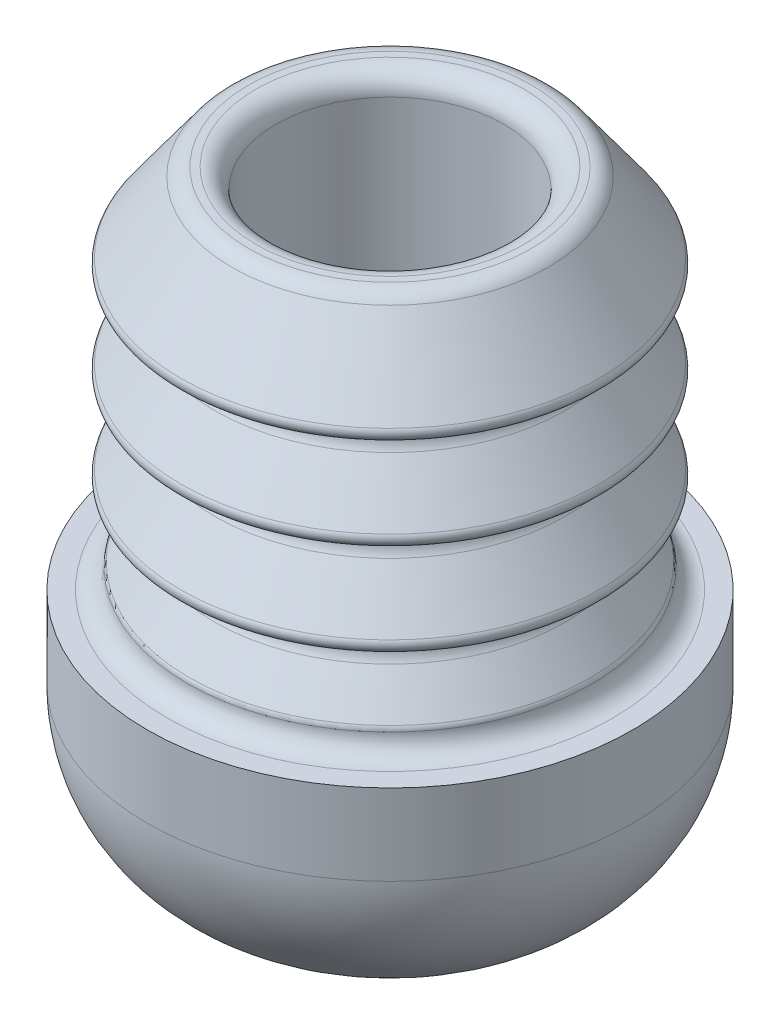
ISO-10303-21;
HEADER;
FILE_DESCRIPTION(('STEP AP214'),'2;1');
FILE_NAME('part.step','',(''),(''),'','','');
FILE_SCHEMA(('AUTOMOTIVE_DESIGN { 1 0 10303 214 1 1 1 1 }'));
ENDSEC;
DATA;
#1=APPLICATION_CONTEXT('core data for automotive mechanical design processes');
#2=APPLICATION_PROTOCOL_DEFINITION('international standard','automotive_design',2000,#1);
#3=PRODUCT_CONTEXT('',#1,'mechanical');
#4=PRODUCT('Part','Part','',(#3));
#5=PRODUCT_RELATED_PRODUCT_CATEGORY('part','',(#4));
#6=PRODUCT_DEFINITION_FORMATION('','',#4);
#7=PRODUCT_DEFINITION_CONTEXT('part definition',#1,'design');
#8=PRODUCT_DEFINITION('design','',#6,#7);
#9=PRODUCT_DEFINITION_SHAPE('','',#8);
#10=(LENGTH_UNIT() NAMED_UNIT(*) SI_UNIT(.MILLI.,.METRE.));
#11=(NAMED_UNIT(*) PLANE_ANGLE_UNIT() SI_UNIT($,.RADIAN.));
#12=(NAMED_UNIT(*) SI_UNIT($,.STERADIAN.) SOLID_ANGLE_UNIT());
#13=UNCERTAINTY_MEASURE_WITH_UNIT(LENGTH_MEASURE(1.E-05),#10,'distance_accuracy_value','');
#14=(GEOMETRIC_REPRESENTATION_CONTEXT(3) GLOBAL_UNCERTAINTY_ASSIGNED_CONTEXT((#13)) GLOBAL_UNIT_ASSIGNED_CONTEXT((#10,
#11,#12)) REPRESENTATION_CONTEXT('',''));
#15=CARTESIAN_POINT('',(0.,0.,0.));
#16=DIRECTION('',(0.,0.,1.));
#17=DIRECTION('',(1.,0.,0.));
#18=AXIS2_PLACEMENT_3D('',#15,#16,#17);
#19=CARTESIAN_POINT('',(77.6422028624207,-3.83900966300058,-0.22700541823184));
#20=DIRECTION('',(0.,1.,0.));
#21=DIRECTION('',(0.,0.,1.));
#22=AXIS2_PLACEMENT_3D('',#19,#20,#21);
#23=PLANE('',#22);
#24=CARTESIAN_POINT('',(77.6422028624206,-3.83900966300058,3.60399263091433));
#25=CARTESIAN_POINT('',(78.3732202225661,-3.83900966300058,3.60359471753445));
#26=CARTESIAN_POINT('',(79.0523729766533,-3.83900966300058,3.33501174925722));
#27=CARTESIAN_POINT('',(79.4121729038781,-3.83900966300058,3.19272250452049));
#28=CARTESIAN_POINT('',(79.7385623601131,-3.83900966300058,2.97952275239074));
#29=CARTESIAN_POINT('',(80.069389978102,-3.83900966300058,2.76342396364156));
#30=CARTESIAN_POINT('',(80.3511275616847,-3.83900966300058,2.48191928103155));
#31=CARTESIAN_POINT('',(80.6306353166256,-3.83900966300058,2.20264258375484));
#32=CARTESIAN_POINT('',(80.8487310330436,-3.83900966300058,1.86935407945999));
#33=CARTESIAN_POINT('',(81.0604896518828,-3.83900966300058,1.54574977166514));
#34=CARTESIAN_POINT('',(81.2042200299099,-3.83900966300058,1.18316469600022));
#35=CARTESIAN_POINT('',(81.472903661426,-3.83900966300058,0.50536313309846));
#36=CARTESIAN_POINT('',(81.4732009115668,-3.83900966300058,-0.227005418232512));
#37=CARTESIAN_POINT('',(81.4734969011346,-3.83900966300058,-0.956268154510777));
#38=CARTESIAN_POINT('',(81.2042200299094,-3.83900966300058,-1.63717553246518));
#39=CARTESIAN_POINT('',(81.0619307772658,-3.83900966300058,-1.99697547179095));
#40=CARTESIAN_POINT('',(80.8487310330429,-3.83900966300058,-2.32336491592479));
#41=CARTESIAN_POINT('',(80.6326322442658,-3.83900966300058,-2.65419253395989));
#42=CARTESIAN_POINT('',(80.3511275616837,-3.83900966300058,-2.93593011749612));
#43=CARTESIAN_POINT('',(80.071850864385,-3.83900966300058,-3.21543787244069));
#44=CARTESIAN_POINT('',(79.7385623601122,-3.83900966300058,-3.43353358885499));
#45=CARTESIAN_POINT('',(79.4149581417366,-3.83900966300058,-3.64529214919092));
#46=CARTESIAN_POINT('',(79.0523729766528,-3.83900966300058,-3.78902258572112));
#47=CARTESIAN_POINT('',(78.3745724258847,-3.83900966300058,-4.05770585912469));
#48=CARTESIAN_POINT('',(77.6422028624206,-3.83900966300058,-4.05800346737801));
#49=B_SPLINE_CURVE_WITH_KNOTS('',2,(#24,#25,#26,#27,#28,#29,#30,#31,#32,#33,#34,#35,#36,#37,#38,
#39,#40,#41,#42,#43,#44,#45,#46,#47,#48),.UNSPECIFIED.,.F.,.F.,(3,2,2,2,2,2,2,2,2,2,2,2,3),(0.,
0.125,0.1875,0.25,0.3125,0.375,0.5,0.625,0.6875,0.75,0.8125,0.875,1.),.UNSPECIFIED.);
#50=CARTESIAN_POINT('',(77.6422028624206,-3.83900966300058,3.60399263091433));
#51=VERTEX_POINT('',#50);
#52=CARTESIAN_POINT('',(77.6422028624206,-3.83900966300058,-4.05800346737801));
#53=VERTEX_POINT('',#52);
#54=EDGE_CURVE('E70',#51,#53,#49,.T.);
#55=ORIENTED_EDGE('',*,*,#54,.T.);
#56=CARTESIAN_POINT('',(77.6422028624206,-3.83900966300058,-4.05800346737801));
#57=CARTESIAN_POINT('',(76.9119519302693,-3.83900966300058,-4.05790862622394));
#58=CARTESIAN_POINT('',(76.2320327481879,-3.83900966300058,-3.78902258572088));
#59=CARTESIAN_POINT('',(75.8722329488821,-3.83900966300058,-3.64673340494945));
#60=CARTESIAN_POINT('',(75.5458433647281,-3.83900966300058,-3.43353358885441));
#61=CARTESIAN_POINT('',(75.2150158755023,-3.83900966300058,-3.21743490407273));
#62=CARTESIAN_POINT('',(74.9332781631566,-3.83900966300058,-2.93593011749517));
#63=CARTESIAN_POINT('',(74.6537705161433,-3.83900966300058,-2.65665355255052));
#64=CARTESIAN_POINT('',(74.4356746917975,-3.83900966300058,-2.32336491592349));
#65=CARTESIAN_POINT('',(74.2239161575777,-3.83900966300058,-1.99976076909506));
#66=CARTESIAN_POINT('',(74.0801856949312,-3.83900966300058,-1.63717553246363));
#67=CARTESIAN_POINT('',(73.8115020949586,-3.83900966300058,-0.959374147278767));
#68=CARTESIAN_POINT('',(73.8112048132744,-3.83900966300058,-0.227005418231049));
#69=CARTESIAN_POINT('',(73.8109087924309,-3.83900966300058,0.502257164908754));
#70=CARTESIAN_POINT('',(74.0801856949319,-3.83900966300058,1.18316469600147));
#71=CARTESIAN_POINT('',(74.2224748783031,-3.83900966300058,1.54296449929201));
#72=CARTESIAN_POINT('',(74.4356746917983,-3.83900966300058,1.86935407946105));
#73=CARTESIAN_POINT('',(74.6517733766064,-3.83900966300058,2.20018156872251));
#74=CARTESIAN_POINT('',(74.9332781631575,-3.83900966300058,2.48191928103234));
#75=CARTESIAN_POINT('',(75.2125547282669,-3.83900966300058,2.76142692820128));
#76=CARTESIAN_POINT('',(75.5458433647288,-3.83900966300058,2.97952275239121));
#77=CARTESIAN_POINT('',(75.8694479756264,-3.83900966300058,3.19128159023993));
#78=CARTESIAN_POINT('',(76.2320327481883,-3.83900966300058,3.33501174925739));
#79=CARTESIAN_POINT('',(76.9106002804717,-3.83900966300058,3.60399882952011));
#80=CARTESIAN_POINT('',(77.6422028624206,-3.83900966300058,3.60399263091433));
#81=B_SPLINE_CURVE_WITH_KNOTS('',2,(#56,#57,#58,#59,#60,#61,#62,#63,#64,#65,#66,#67,#68,#69,#70,
#71,#72,#73,#74,#75,#76,#77,#78,#79,#80),.UNSPECIFIED.,.F.,.F.,(3,2,2,2,2,2,2,2,2,2,2,2,3),(0.,
0.125,0.1875,0.25,0.3125,0.375,0.5,0.625,0.6875,0.75,0.8125,0.875,1.),.UNSPECIFIED.);
#82=EDGE_CURVE('E68',#53,#51,#81,.T.);
#83=ORIENTED_EDGE('',*,*,#82,.T.);
#84=EDGE_LOOP('',(#55,#83));
#85=FACE_BOUND('',#84,.T.);
#86=ADVANCED_FACE('F17',(#85),#23,.T.);
#87=CARTESIAN_POINT('',(77.6422028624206,-3.33900966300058,-0.22700541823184));
#88=DIRECTION('',(0.,1.,0.));
#89=DIRECTION('',(-1.,0.,0.));
#90=AXIS2_PLACEMENT_3D('',#87,#88,#89);
#91=TOROIDAL_SURFACE('',#90,3.83099804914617,0.5);
#92=CARTESIAN_POINT('',(77.6422028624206,-3.33900966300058,-0.22700541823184));
#93=DIRECTION('',(0.,-1.,0.));
#94=DIRECTION('',(0.,0.,-1.));
#95=AXIS2_PLACEMENT_3D('',#92,#93,#94);
#96=CIRCLE('',#95,4.33099804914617);
#97=CARTESIAN_POINT('',(77.6422028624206,-3.33900966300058,-4.55800346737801));
#98=VERTEX_POINT('',#97);
#99=EDGE_CURVE('E74',#98,#98,#96,.F.);
#100=ORIENTED_EDGE('',*,*,#99,.T.);
#101=EDGE_LOOP('',(#100));
#102=FACE_BOUND('',#101,.T.);
#103=ORIENTED_EDGE('',*,*,#54,.F.);
#104=ORIENTED_EDGE('',*,*,#82,.F.);
#105=EDGE_LOOP('',(#103,#104));
#106=FACE_BOUND('',#105,.T.);
#107=ADVANCED_FACE('F73',(#102,#106),#91,.F.);
#108=CARTESIAN_POINT('',(77.6422028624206,-0.839009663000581,-0.22700541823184));
#109=DIRECTION('',(0.,-1.,0.));
#110=DIRECTION('',(0.,0.,-1.));
#111=AXIS2_PLACEMENT_3D('',#108,#109,#110);
#112=CYLINDRICAL_SURFACE('',#111,4.33099804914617);
#113=ORIENTED_EDGE('',*,*,#99,.F.);
#114=EDGE_LOOP('',(#113));
#115=FACE_BOUND('',#114,.T.);
#116=CARTESIAN_POINT('',(77.6422028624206,-0.94755740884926,-0.22700541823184));
#117=DIRECTION('',(0.,1.,0.));
#118=DIRECTION('',(0.,0.,1.));
#119=AXIS2_PLACEMENT_3D('',#116,#117,#118);
#120=CIRCLE('',#119,4.33099804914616);
#121=CARTESIAN_POINT('',(77.6422028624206,-0.94755740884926,4.10399263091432));
#122=VERTEX_POINT('',#121);
#123=EDGE_CURVE('E77',#122,#122,#120,.T.);
#124=ORIENTED_EDGE('',*,*,#123,.T.);
#125=EDGE_LOOP('',(#124));
#126=FACE_BOUND('',#125,.T.);
#127=ADVANCED_FACE('F94',(#115,#126),#112,.F.);
#128=CARTESIAN_POINT('',(77.6422028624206,-0.94755740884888,-0.22700541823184));
#129=DIRECTION('',(0.,1.,0.));
#130=DIRECTION('',(0.,0.,1.));
#131=AXIS2_PLACEMENT_3D('',#128,#129,#130);
#132=TOROIDAL_SURFACE('',#131,3.83099804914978,0.499999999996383);
#133=CARTESIAN_POINT('',(77.6422028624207,-0.839009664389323,-0.22700541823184));
#134=DIRECTION('',(0.,-1.,0.));
#135=DIRECTION('',(0.,0.,-1.));
#136=AXIS2_PLACEMENT_3D('',#133,#134,#135);
#137=CIRCLE('',#136,4.31907323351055);
#138=CARTESIAN_POINT('',(77.6422028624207,-0.839009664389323,-4.54607865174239));
#139=VERTEX_POINT('',#138);
#140=EDGE_CURVE('E498',#139,#139,#137,.F.);
#141=ORIENTED_EDGE('',*,*,#140,.T.);
#142=EDGE_LOOP('',(#141));
#143=FACE_BOUND('',#142,.T.);
#144=ORIENTED_EDGE('',*,*,#123,.F.);
#145=EDGE_LOOP('',(#144));
#146=FACE_BOUND('',#145,.T.);
#147=ADVANCED_FACE('F100',(#143,#146),#132,.F.);
#148=CARTESIAN_POINT('',(77.6422028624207,-0.839009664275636,-0.22700541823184));
#149=DIRECTION('',(0.,-1.,0.));
#150=DIRECTION('',(0.,0.,-1.));
#151=AXIS2_PLACEMENT_3D('',#148,#149,#150);
#152=CONICAL_SURFACE('',#151,4.31907323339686,0.785398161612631);
#153=CARTESIAN_POINT('',(77.6422028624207,0.514543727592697,-0.22700541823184));
#154=DIRECTION('',(0.,-1.,0.));
#155=DIRECTION('',(0.,0.,-1.));
#156=AXIS2_PLACEMENT_3D('',#153,#154,#155);
#157=CIRCLE('',#156,2.96551984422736);
#158=CARTESIAN_POINT('',(77.6422028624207,0.514543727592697,-3.1925252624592));
#159=VERTEX_POINT('',#158);
#160=EDGE_CURVE('E501',#159,#159,#157,.T.);
#161=ORIENTED_EDGE('',*,*,#160,.F.);
#162=EDGE_LOOP('',(#161));
#163=FACE_BOUND('',#162,.T.);
#164=ORIENTED_EDGE('',*,*,#140,.F.);
#165=EDGE_LOOP('',(#164));
#166=FACE_BOUND('',#165,.T.);
#167=ADVANCED_FACE('F103',(#163,#166),#152,.F.);
#168=CARTESIAN_POINT('',(77.6422028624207,0.868097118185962,-0.22700541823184));
#169=DIRECTION('',(0.,1.,0.));
#170=DIRECTION('',(0.,0.,1.));
#171=AXIS2_PLACEMENT_3D('',#168,#169,#170);
#172=TOROIDAL_SURFACE('',#171,3.31907323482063,0.499999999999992);
#173=ORIENTED_EDGE('',*,*,#160,.T.);
#174=EDGE_LOOP('',(#173));
#175=FACE_BOUND('',#174,.T.);
#176=CARTESIAN_POINT('',(77.6422028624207,0.868097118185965,-0.22700541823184));
#177=DIRECTION('',(0.,1.,0.));
#178=DIRECTION('',(0.,0.,1.));
#179=AXIS2_PLACEMENT_3D('',#176,#177,#178);
#180=CIRCLE('',#179,2.81907323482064);
#181=CARTESIAN_POINT('',(77.6422028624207,0.868097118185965,2.5920678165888));
#182=VERTEX_POINT('',#181);
#183=EDGE_CURVE('E506',#182,#182,#180,.T.);
#184=ORIENTED_EDGE('',*,*,#183,.T.);
#185=EDGE_LOOP('',(#184));
#186=FACE_BOUND('',#185,.T.);
#187=ADVANCED_FACE('F105',(#175,#186),#172,.T.);
#188=CARTESIAN_POINT('',(77.6422028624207,-3.83900966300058,-0.22700541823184));
#189=DIRECTION('',(0.,1.,0.));
#190=DIRECTION('',(0.,0.,1.));
#191=AXIS2_PLACEMENT_3D('',#188,#189,#190);
#192=CYLINDRICAL_SURFACE('',#191,2.81907323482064);
#193=ORIENTED_EDGE('',*,*,#183,.F.);
#194=EDGE_LOOP('',(#193));
#195=FACE_BOUND('',#194,.T.);
#196=CARTESIAN_POINT('',(77.6422028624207,8.56099033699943,-0.22700541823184));
#197=DIRECTION('',(0.,-1.,0.));
#198=DIRECTION('',(0.,0.,-1.));
#199=AXIS2_PLACEMENT_3D('',#196,#197,#198);
#200=CIRCLE('',#199,2.81907323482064);
#201=CARTESIAN_POINT('',(77.6422028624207,8.56099033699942,-3.04607865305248));
#202=VERTEX_POINT('',#201);
#203=EDGE_CURVE('E509',#202,#202,#200,.T.);
#204=ORIENTED_EDGE('',*,*,#203,.F.);
#205=EDGE_LOOP('',(#204));
#206=FACE_BOUND('',#205,.T.);
#207=ADVANCED_FACE('F108',(#195,#206),#192,.F.);
#208=CARTESIAN_POINT('',(77.6422028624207,8.56099033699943,-0.22700541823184));
#209=DIRECTION('',(0.,1.,0.));
#210=DIRECTION('',(0.,0.,1.));
#211=AXIS2_PLACEMENT_3D('',#208,#209,#210);
#212=TOROIDAL_SURFACE('',#211,3.31907323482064,0.5);
#213=ORIENTED_EDGE('',*,*,#203,.T.);
#214=EDGE_LOOP('',(#213));
#215=FACE_BOUND('',#214,.T.);
#216=CARTESIAN_POINT('',(77.6422028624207,9.06099033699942,-3.54607865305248));
#217=CARTESIAN_POINT('',(78.2748152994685,9.06099033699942,-3.54599122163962));
#218=CARTESIAN_POINT('',(78.8639361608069,9.06099033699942,-3.3130408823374));
#219=CARTESIAN_POINT('',(79.5018424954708,9.06099033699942,-3.06079977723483));
#220=CARTESIAN_POINT('',(79.9891420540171,9.06099033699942,-2.57394460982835));
#221=CARTESIAN_POINT('',(80.4743031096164,9.06099033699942,-2.08922599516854));
#222=CARTESIAN_POINT('',(80.7282383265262,9.06099033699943,-1.44873871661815));
#223=CARTESIAN_POINT('',(80.9609860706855,9.06099033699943,-0.861691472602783));
#224=CARTESIAN_POINT('',(80.9612760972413,9.06099033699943,-0.227005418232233));
#225=CARTESIAN_POINT('',(80.9615647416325,9.06099033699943,0.404655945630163));
#226=CARTESIAN_POINT('',(80.7282383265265,9.06099033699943,0.994727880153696));
#227=CARTESIAN_POINT('',(80.4759972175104,9.06099033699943,1.63263421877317));
#228=CARTESIAN_POINT('',(79.9891420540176,9.06099033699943,2.11993377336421));
#229=CARTESIAN_POINT('',(79.5044229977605,9.06099033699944,2.60509527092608));
#230=CARTESIAN_POINT('',(78.8639361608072,9.06099033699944,2.85903004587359));
#231=CARTESIAN_POINT('',(78.2761224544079,9.06099033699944,3.09208142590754));
#232=CARTESIAN_POINT('',(77.6422028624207,9.06099033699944,3.09206781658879));
#233=B_SPLINE_CURVE_WITH_KNOTS('',2,(#216,#217,#218,#219,#220,#221,#222,#223,#224,#225,#226,
#227,#228,#229,#230,#231,#232),.UNSPECIFIED.,.F.,.F.,(3,2,2,2,2,2,2,2,3),(0.,0.125,0.25,0.375,
0.5,0.625,0.75,0.875,1.),.UNSPECIFIED.);
#234=CARTESIAN_POINT('',(77.6422028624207,9.06099033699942,-3.54607865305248));
#235=VERTEX_POINT('',#234);
#236=CARTESIAN_POINT('',(77.6422028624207,9.06099033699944,3.0920678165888));
#237=VERTEX_POINT('',#236);
#238=EDGE_CURVE('E282',#235,#237,#233,.T.);
#239=ORIENTED_EDGE('',*,*,#238,.F.);
#240=CARTESIAN_POINT('',(77.6422028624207,9.06099033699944,3.09206781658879));
#241=CARTESIAN_POINT('',(77.0088244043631,9.06099033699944,3.09167735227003));
#242=CARTESIAN_POINT('',(76.4204695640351,9.06099033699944,2.85903004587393));
#243=CARTESIAN_POINT('',(75.7825633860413,9.06099033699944,2.60678914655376));
#244=CARTESIAN_POINT('',(75.2952636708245,9.06099033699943,2.11993377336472));
#245=CARTESIAN_POINT('',(74.8101025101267,9.06099033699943,1.63521500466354));
#246=CARTESIAN_POINT('',(74.556167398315,9.06099033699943,0.994727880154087));
#247=CARTESIAN_POINT('',(74.323419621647,9.06099033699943,0.407680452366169));
#248=CARTESIAN_POINT('',(74.3231296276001,9.06099033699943,-0.227005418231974));
#249=CARTESIAN_POINT('',(74.3228410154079,9.06099033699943,-0.858666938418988));
#250=CARTESIAN_POINT('',(74.5561673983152,9.06099033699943,-1.44873871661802));
#251=CARTESIAN_POINT('',(74.8084085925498,9.06099033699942,-2.08664518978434));
#252=CARTESIAN_POINT('',(75.2952636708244,9.06099033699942,-2.57394460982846));
#253=CARTESIAN_POINT('',(75.7799823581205,9.06099033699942,-3.05910568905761));
#254=CARTESIAN_POINT('',(76.420469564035,9.06099033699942,-3.31304088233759));
#255=CARTESIAN_POINT('',(77.0075162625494,9.06099033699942,-3.54578841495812));
#256=CARTESIAN_POINT('',(77.6422028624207,9.06099033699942,-3.54607865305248));
#257=B_SPLINE_CURVE_WITH_KNOTS('',2,(#240,#241,#242,#243,#244,#245,#246,#247,#248,#249,#250,
#251,#252,#253,#254,#255,#256),.UNSPECIFIED.,.F.,.F.,(3,2,2,2,2,2,2,2,3),(0.,0.125,0.25,0.375,
0.5,0.625,0.75,0.875,1.),.UNSPECIFIED.);
#258=EDGE_CURVE('E512',#237,#235,#257,.T.);
#259=ORIENTED_EDGE('',*,*,#258,.F.);
#260=EDGE_LOOP('',(#239,#259));
#261=FACE_BOUND('',#260,.T.);
#262=ADVANCED_FACE('F110',(#215,#261),#212,.T.);
#263=CARTESIAN_POINT('',(77.6422028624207,9.06099033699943,-0.227005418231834));
#264=DIRECTION('',(0.,1.,0.));
#265=DIRECTION('',(0.,0.,1.));
#266=AXIS2_PLACEMENT_3D('',#263,#264,#265);
#267=PLANE('',#266);
#268=CARTESIAN_POINT('',(77.6422028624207,9.06099033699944,-0.227005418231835));
#269=DIRECTION('',(0.,1.,0.));
#270=DIRECTION('',(0.,0.,1.));
#271=AXIS2_PLACEMENT_3D('',#268,#269,#270);
#272=CIRCLE('',#271,3.4994385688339);
#273=CARTESIAN_POINT('',(77.6422028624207,9.06099033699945,3.27243315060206));
#274=VERTEX_POINT('',#273);
#275=EDGE_CURVE('E279',#274,#274,#272,.F.);
#276=ORIENTED_EDGE('',*,*,#275,.F.);
#277=EDGE_LOOP('',(#276));
#278=FACE_BOUND('',#277,.T.);
#279=ORIENTED_EDGE('',*,*,#258,.T.);
#280=ORIENTED_EDGE('',*,*,#238,.T.);
#281=EDGE_LOOP('',(#279,#280));
#282=FACE_BOUND('',#281,.T.);
#283=ADVANCED_FACE('F113',(#278,#282),#267,.T.);
#284=CARTESIAN_POINT('',(77.6422028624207,8.56099033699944,-0.227005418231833));
#285=DIRECTION('',(0.,1.,0.));
#286=DIRECTION('',(0.,0.,1.));
#287=AXIS2_PLACEMENT_3D('',#284,#285,#286);
#288=TOROIDAL_SURFACE('',#287,3.49943856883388,0.500000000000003);
#289=CARTESIAN_POINT('',(77.6422028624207,8.85488296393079,-0.227005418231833));
#290=DIRECTION('',(0.,-1.,0.));
#291=DIRECTION('',(0.,0.,-1.));
#292=AXIS2_PLACEMENT_3D('',#289,#290,#291);
#293=CIRCLE('',#292,3.90394706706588);
#294=CARTESIAN_POINT('',(77.6422028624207,8.85488296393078,-4.13095248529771));
#295=VERTEX_POINT('',#294);
#296=EDGE_CURVE('E281',#295,#295,#293,.T.);
#297=ORIENTED_EDGE('',*,*,#296,.F.);
#298=EDGE_LOOP('',(#297));
#299=FACE_BOUND('',#298,.T.);
#300=ORIENTED_EDGE('',*,*,#275,.T.);
#301=EDGE_LOOP('',(#300));
#302=FACE_BOUND('',#301,.T.);
#303=ADVANCED_FACE('F115',(#299,#302),#288,.T.);
#304=CARTESIAN_POINT('',(77.6422028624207,7.11329980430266,-0.227005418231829));
#305=DIRECTION('',(0.,-1.,0.));
#306=DIRECTION('',(0.,0.,-1.));
#307=AXIS2_PLACEMENT_3D('',#304,#305,#306);
#308=CONICAL_SURFACE('',#307,5.16928129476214,0.628318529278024);
#309=ORIENTED_EDGE('',*,*,#296,.T.);
#310=EDGE_LOOP('',(#309));
#311=FACE_BOUND('',#310,.T.);
#312=CARTESIAN_POINT('',(77.6422028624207,7.11329980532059,-0.22700541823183));
#313=DIRECTION('',(0.,-1.,0.));
#314=DIRECTION('',(0.,0.,-1.));
#315=AXIS2_PLACEMENT_3D('',#312,#313,#314);
#316=CIRCLE('',#315,5.16928129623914);
#317=CARTESIAN_POINT('',(77.6422028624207,7.11329980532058,-5.39628671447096));
#318=VERTEX_POINT('',#317);
#319=EDGE_CURVE('E278',#318,#318,#316,.T.);
#320=ORIENTED_EDGE('',*,*,#319,.F.);
#321=EDGE_LOOP('',(#320));
#322=FACE_BOUND('',#321,.T.);
#323=ADVANCED_FACE('F118',(#311,#322),#308,.T.);
#324=CARTESIAN_POINT('',(77.6422028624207,6.99574275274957,-0.22700541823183));
#325=DIRECTION('',(0.,-1.,0.));
#326=DIRECTION('',(0.,0.,-1.));
#327=AXIS2_PLACEMENT_3D('',#324,#325,#326);
#328=TOROIDAL_SURFACE('',#327,5.00747789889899,0.199999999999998);
#329=ORIENTED_EDGE('',*,*,#319,.T.);
#330=EDGE_LOOP('',(#329));
#331=FACE_BOUND('',#330,.T.);
#332=CARTESIAN_POINT('',(77.6422028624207,6.79574275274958,-0.22700541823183));
#333=DIRECTION('',(0.,-1.,0.));
#334=DIRECTION('',(0.,0.,-1.));
#335=AXIS2_PLACEMENT_3D('',#332,#333,#334);
#336=CIRCLE('',#335,5.00747789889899);
#337=CARTESIAN_POINT('',(77.6422028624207,6.79574275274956,-5.23448331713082));
#338=VERTEX_POINT('',#337);
#339=EDGE_CURVE('E274',#338,#338,#336,.T.);
#340=ORIENTED_EDGE('',*,*,#339,.F.);
#341=EDGE_LOOP('',(#340));
#342=FACE_BOUND('',#341,.T.);
#343=ADVANCED_FACE('F120',(#331,#342),#328,.T.);
#344=CARTESIAN_POINT('',(77.6422028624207,6.79574275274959,5.17299458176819));
#345=DIRECTION('',(0.,-1.,0.));
#346=DIRECTION('',(0.,0.,-1.));
#347=AXIS2_PLACEMENT_3D('',#344,#345,#346);
#348=PLANE('',#347);
#349=CARTESIAN_POINT('',(77.6422028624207,6.79574275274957,-4.96251196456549));
#350=CARTESIAN_POINT('',(76.7386567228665,6.79574275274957,-4.96211402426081));
#351=CARTESIAN_POINT('',(75.8990879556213,6.79574275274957,-4.63002400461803));
#352=CARTESIAN_POINT('',(75.4540283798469,6.79574275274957,-4.45398143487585));
#353=CARTESIAN_POINT('',(75.0508874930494,6.79574275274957,-4.1906031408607));
#354=CARTESIAN_POINT('',(74.6416628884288,6.79574275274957,-3.92325025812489));
#355=CARTESIAN_POINT('',(74.2936940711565,6.79574275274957,-3.57551420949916));
#356=CARTESIAN_POINT('',(73.9479553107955,6.79574275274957,-3.23000672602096));
#357=CARTESIAN_POINT('',(73.6786051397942,6.79574275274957,-2.81832078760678));
#358=CARTESIAN_POINT('',(73.4166680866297,6.79574275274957,-2.41796536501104));
#359=CARTESIAN_POINT('',(73.2391842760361,6.79574275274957,-1.97012032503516));
#360=CARTESIAN_POINT('',(72.9069934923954,6.79574275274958,-1.13190305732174));
#361=CARTESIAN_POINT('',(72.9066963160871,6.79574275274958,-0.227005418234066));
#362=CARTESIAN_POINT('',(72.9064001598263,6.79574275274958,0.674786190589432));
#363=CARTESIAN_POINT('',(73.2391842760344,6.79574275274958,1.51610948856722));
#364=CARTESIAN_POINT('',(73.4152269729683,6.79574275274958,1.96116925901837));
#365=CARTESIAN_POINT('',(73.6786051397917,6.79574275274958,2.36430995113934));
#366=CARTESIAN_POINT('',(73.9459580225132,6.79574275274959,2.77353455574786));
#367=CARTESIAN_POINT('',(74.2936940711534,6.79574275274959,3.12150337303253));
#368=CARTESIAN_POINT('',(74.6392015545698,6.79574275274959,3.46724213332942));
#369=CARTESIAN_POINT('',(75.0508874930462,6.79574275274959,3.73659230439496));
#370=CARTESIAN_POINT('',(75.4512428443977,6.79574275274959,3.99852931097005));
#371=CARTESIAN_POINT('',(75.8990879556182,6.79574275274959,4.1760131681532));
#372=CARTESIAN_POINT('',(76.7373043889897,6.79574275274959,4.50820365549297));
#373=CARTESIAN_POINT('',(77.6422028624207,6.79574275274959,4.50850112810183));
#374=B_SPLINE_CURVE_WITH_KNOTS('',2,(#349,#350,#351,#352,#353,#354,#355,#356,#357,#358,#359,
#360,#361,#362,#363,#364,#365,#366,#367,#368,#369,#370,#371,#372,#373),.UNSPECIFIED.,.F.,.F.,(3,
2,2,2,2,2,2,2,2,2,2,2,3),(0.,0.125,0.1875,0.25,0.3125,0.375,0.5,0.625,0.6875,0.75,0.8125,0.875,
1.),.UNSPECIFIED.);
#375=CARTESIAN_POINT('',(77.6422028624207,6.79574275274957,-4.96251196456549));
#376=VERTEX_POINT('',#375);
#377=CARTESIAN_POINT('',(77.6422028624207,6.79574275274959,4.50850112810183));
#378=VERTEX_POINT('',#377);
#379=EDGE_CURVE('E531',#376,#378,#374,.T.);
#380=ORIENTED_EDGE('',*,*,#379,.T.);
#381=CARTESIAN_POINT('',(77.6422028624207,6.79574275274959,4.50850112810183));
#382=CARTESIAN_POINT('',(78.5449825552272,6.79574275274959,4.5084063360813));
#383=CARTESIAN_POINT('',(79.3853177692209,6.79574275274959,4.17601316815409));
#384=CARTESIAN_POINT('',(79.8303772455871,6.79574275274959,3.99997064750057));
#385=CARTESIAN_POINT('',(80.2335182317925,6.79574275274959,3.73659230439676));
#386=CARTESIAN_POINT('',(80.6427427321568,6.79574275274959,3.46923950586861));
#387=CARTESIAN_POINT('',(80.9907116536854,6.79574275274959,3.12150337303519));
#388=CARTESIAN_POINT('',(81.3364503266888,6.79574275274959,2.77599599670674));
#389=CARTESIAN_POINT('',(81.6058005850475,6.79574275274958,2.36430995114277));
#390=CARTESIAN_POINT('',(81.8677375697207,6.79574275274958,1.96395465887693));
#391=CARTESIAN_POINT('',(82.0452214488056,6.79574275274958,1.51610948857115));
#392=CARTESIAN_POINT('',(82.3774122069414,6.79574275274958,0.677892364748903));
#393=CARTESIAN_POINT('',(82.3777094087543,6.79574275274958,-0.227005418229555));
#394=CARTESIAN_POINT('',(82.3780055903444,6.79574275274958,-1.12879690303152));
#395=CARTESIAN_POINT('',(82.0452214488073,6.79574275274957,-1.97012032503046));
#396=CARTESIAN_POINT('',(81.8691788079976,6.79574275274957,-2.41517998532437));
#397=CARTESIAN_POINT('',(81.6058005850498,6.79574275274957,-2.81832078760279));
#398=CARTESIAN_POINT('',(81.3384477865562,6.79574275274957,-3.22754528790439));
#399=CARTESIAN_POINT('',(80.990711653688,6.79574275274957,-3.57551420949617));
#400=CARTESIAN_POINT('',(80.6452042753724,6.79574275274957,-3.92125288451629));
#401=CARTESIAN_POINT('',(80.2335182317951,6.79574275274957,-4.19060314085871));
#402=CARTESIAN_POINT('',(79.8331542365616,6.79574275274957,-4.4525458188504));
#403=CARTESIAN_POINT('',(79.3853177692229,6.79574275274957,-4.63002400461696));
#404=CARTESIAN_POINT('',(78.9585468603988,6.79574275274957,-4.79915388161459));
#405=CARTESIAN_POINT('',(78.50389008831,6.79574275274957,-4.88345442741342));
#406=CARTESIAN_POINT('',(78.0774890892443,6.79574275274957,-4.9625159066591));
#407=CARTESIAN_POINT('',(77.6422028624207,6.79574275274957,-4.96251196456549));
#408=B_SPLINE_CURVE_WITH_KNOTS('',2,(#381,#382,#383,#384,#385,#386,#387,#388,#389,#390,#391,
#392,#393,#394,#395,#396,#397,#398,#399,#400,#401,#402,#403,#404,#405,#406,#407),.UNSPECIFIED.,
.F.,.F.,(3,2,2,2,2,2,2,2,2,2,2,2,2,3),(0.,0.125,0.1875,0.25,0.3125,0.375,0.5,0.625,0.6875,0.75,
0.8125,0.875,0.9375,1.),.UNSPECIFIED.);
#409=EDGE_CURVE('E277',#378,#376,#408,.T.);
#410=ORIENTED_EDGE('',*,*,#409,.T.);
#411=EDGE_LOOP('',(#380,#410));
#412=FACE_BOUND('',#411,.T.);
#413=ORIENTED_EDGE('',*,*,#339,.T.);
#414=EDGE_LOOP('',(#413));
#415=FACE_BOUND('',#414,.T.);
#416=ADVANCED_FACE('F123',(#412,#415),#348,.T.);
#417=CARTESIAN_POINT('',(77.6422028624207,6.29574275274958,-0.227005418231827));
#418=DIRECTION('',(0.,-1.,0.));
#419=DIRECTION('',(0.,0.,-1.));
#420=AXIS2_PLACEMENT_3D('',#417,#418,#419);
#421=TOROIDAL_SURFACE('',#420,4.73550654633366,0.5);
#422=ORIENTED_EDGE('',*,*,#379,.F.);
#423=ORIENTED_EDGE('',*,*,#409,.F.);
#424=EDGE_LOOP('',(#422,#423));
#425=FACE_BOUND('',#424,.T.);
#426=CARTESIAN_POINT('',(77.6422028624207,6.00185012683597,-0.227005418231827));
#427=DIRECTION('',(0.,-1.,0.));
#428=DIRECTION('',(0.,0.,-1.));
#429=AXIS2_PLACEMENT_3D('',#426,#427,#428);
#430=CIRCLE('',#429,4.33099804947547);
#431=CARTESIAN_POINT('',(77.6422028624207,6.00185012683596,-4.55800346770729));
#432=VERTEX_POINT('',#431);
#433=EDGE_CURVE('E534',#432,#432,#430,.T.);
#434=ORIENTED_EDGE('',*,*,#433,.F.);
#435=EDGE_LOOP('',(#434));
#436=FACE_BOUND('',#435,.T.);
#437=ADVANCED_FACE('F125',(#425,#436),#421,.F.);
#438=CARTESIAN_POINT('',(77.6422028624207,4.84805221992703,-0.227005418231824));
#439=DIRECTION('',(0.,-1.,0.));
#440=DIRECTION('',(0.,0.,-1.));
#441=AXIS2_PLACEMENT_3D('',#438,#439,#440);
#442=CONICAL_SURFACE('',#441,5.16928129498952,0.628318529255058);
#443=ORIENTED_EDGE('',*,*,#433,.T.);
#444=EDGE_LOOP('',(#443));
#445=FACE_BOUND('',#444,.T.);
#446=CARTESIAN_POINT('',(77.6422028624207,4.84805222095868,-0.227005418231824));
#447=DIRECTION('',(0.,-1.,0.));
#448=DIRECTION('',(0.,0.,-1.));
#449=AXIS2_PLACEMENT_3D('',#446,#447,#448);
#450=CIRCLE('',#449,5.16928129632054);
#451=CARTESIAN_POINT('',(77.6422028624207,4.84805222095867,-5.39628671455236));
#452=VERTEX_POINT('',#451);
#453=EDGE_CURVE('E273',#452,#452,#450,.T.);
#454=ORIENTED_EDGE('',*,*,#453,.F.);
#455=EDGE_LOOP('',(#454));
#456=FACE_BOUND('',#455,.T.);
#457=ADVANCED_FACE('F128',(#445,#456),#442,.T.);
#458=CARTESIAN_POINT('',(77.6422028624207,4.73049516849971,-0.227005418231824));
#459=DIRECTION('',(0.,-1.,0.));
#460=DIRECTION('',(0.,0.,-1.));
#461=AXIS2_PLACEMENT_3D('',#458,#459,#460);
#462=TOROIDAL_SURFACE('',#461,5.00747789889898,0.199999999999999);
#463=ORIENTED_EDGE('',*,*,#453,.T.);
#464=EDGE_LOOP('',(#463));
#465=FACE_BOUND('',#464,.T.);
#466=CARTESIAN_POINT('',(77.6422028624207,4.53049516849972,-0.227005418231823));
#467=DIRECTION('',(0.,-1.,0.));
#468=DIRECTION('',(0.,0.,-1.));
#469=AXIS2_PLACEMENT_3D('',#466,#467,#468);
#470=CIRCLE('',#469,5.00747789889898);
#471=CARTESIAN_POINT('',(77.6422028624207,4.5304951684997,-5.2344833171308));
#472=VERTEX_POINT('',#471);
#473=EDGE_CURVE('E270',#472,#472,#470,.T.);
#474=ORIENTED_EDGE('',*,*,#473,.F.);
#475=EDGE_LOOP('',(#474));
#476=FACE_BOUND('',#475,.T.);
#477=ADVANCED_FACE('F130',(#465,#476),#462,.T.);
#478=CARTESIAN_POINT('',(77.6422028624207,4.53049516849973,5.17299458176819));
#479=DIRECTION('',(0.,-1.,0.));
#480=DIRECTION('',(0.,0.,-1.));
#481=AXIS2_PLACEMENT_3D('',#478,#479,#480);
#482=PLANE('',#481);
#483=CARTESIAN_POINT('',(77.6422028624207,4.53049516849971,-4.96251196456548));
#484=CARTESIAN_POINT('',(76.7386567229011,4.53049516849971,-4.96211402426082));
#485=CARTESIAN_POINT('',(75.899087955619,4.53049516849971,-4.63002400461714));
#486=CARTESIAN_POINT('',(75.4540283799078,4.53049516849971,-4.45398143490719));
#487=CARTESIAN_POINT('',(75.0508874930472,4.53049516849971,-4.19060314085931));
#488=CARTESIAN_POINT('',(74.6416628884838,4.53049516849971,-3.92325025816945));
#489=CARTESIAN_POINT('',(74.2936940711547,4.53049516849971,-3.57551420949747));
#490=CARTESIAN_POINT('',(73.9479553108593,4.53049516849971,-3.23000672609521));
#491=CARTESIAN_POINT('',(73.678605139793,4.53049516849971,-2.81832078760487));
#492=CARTESIAN_POINT('',(73.4166680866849,4.53049516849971,-2.41796536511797));
#493=CARTESIAN_POINT('',(73.2391842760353,4.53049516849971,-1.97012032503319));
#494=CARTESIAN_POINT('',(72.9069934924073,4.53049516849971,-1.13190305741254));
#495=CARTESIAN_POINT('',(72.9066963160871,4.53049516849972,-0.227005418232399));
#496=CARTESIAN_POINT('',(72.9064001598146,4.53049516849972,0.67478619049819));
#497=CARTESIAN_POINT('',(73.2391842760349,4.53049516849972,1.51610948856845));
#498=CARTESIAN_POINT('',(73.4152269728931,4.53049516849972,1.96116925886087));
#499=CARTESIAN_POINT('',(73.6786051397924,4.53049516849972,2.36430995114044));
#500=CARTESIAN_POINT('',(73.9459580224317,4.53049516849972,2.77353455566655));
#501=CARTESIAN_POINT('',(74.2936940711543,4.53049516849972,3.1215033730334));
#502=CARTESIAN_POINT('',(74.6392015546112,4.53049516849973,3.46724213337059));
#503=CARTESIAN_POINT('',(75.050887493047,4.53049516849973,3.73659230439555));
#504=CARTESIAN_POINT('',(75.4512428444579,4.53049516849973,3.99852931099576));
#505=CARTESIAN_POINT('',(75.8990879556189,4.53049516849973,4.17601316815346));
#506=CARTESIAN_POINT('',(76.7373043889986,4.53049516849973,4.50820365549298));
#507=CARTESIAN_POINT('',(77.6422028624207,4.53049516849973,4.50850112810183));
#508=B_SPLINE_CURVE_WITH_KNOTS('',2,(#483,#484,#485,#486,#487,#488,#489,#490,#491,#492,#493,
#494,#495,#496,#497,#498,#499,#500,#501,#502,#503,#504,#505,#506,#507),.UNSPECIFIED.,.F.,.F.,(3,
2,2,2,2,2,2,2,2,2,2,2,3),(0.,0.125,0.1875,0.25,0.3125,0.375,0.5,0.625,0.6875,0.75,0.8125,0.875,
1.),.UNSPECIFIED.);
#509=CARTESIAN_POINT('',(77.6422028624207,4.53049516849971,-4.96251196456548));
#510=VERTEX_POINT('',#509);
#511=CARTESIAN_POINT('',(77.6422028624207,4.53049516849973,4.50850112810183));
#512=VERTEX_POINT('',#511);
#513=EDGE_CURVE('E252',#510,#512,#508,.T.);
#514=ORIENTED_EDGE('',*,*,#513,.T.);
#515=CARTESIAN_POINT('',(77.6422028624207,4.53049516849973,4.50850112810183));
#516=CARTESIAN_POINT('',(78.544982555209,4.53049516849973,4.50840633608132));
#517=CARTESIAN_POINT('',(79.3853177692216,4.53049516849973,4.17601316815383));
#518=CARTESIAN_POINT('',(79.8303772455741,4.53049516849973,3.9999706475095));
#519=CARTESIAN_POINT('',(80.2335182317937,4.53049516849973,3.73659230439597));
#520=CARTESIAN_POINT('',(80.6427427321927,4.53049516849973,3.46923950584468));
#521=CARTESIAN_POINT('',(80.9907116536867,4.53049516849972,3.12150337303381));
#522=CARTESIAN_POINT('',(81.3364503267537,4.53049516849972,2.77599599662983));
#523=CARTESIAN_POINT('',(81.6058005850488,4.53049516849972,2.36430995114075));
#524=CARTESIAN_POINT('',(81.8677375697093,4.53049516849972,1.96395465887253));
#525=CARTESIAN_POINT('',(82.0452214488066,4.53049516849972,1.51610948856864));
#526=CARTESIAN_POINT('',(82.3774122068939,4.53049516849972,0.677892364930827));
#527=CARTESIAN_POINT('',(82.3777094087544,4.53049516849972,-0.2270054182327));
#528=CARTESIAN_POINT('',(82.3780055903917,4.53049516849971,-1.12879690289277));
#529=CARTESIAN_POINT('',(82.0452214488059,4.53049516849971,-1.97012032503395));
#530=CARTESIAN_POINT('',(81.8691788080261,4.53049516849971,-2.41517998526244));
#531=CARTESIAN_POINT('',(81.605800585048,4.53049516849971,-2.81832078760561));
#532=CARTESIAN_POINT('',(81.3384477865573,4.53049516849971,-3.22754528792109));
#533=CARTESIAN_POINT('',(80.990711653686,4.53049516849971,-3.57551420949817));
#534=CARTESIAN_POINT('',(80.6452042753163,4.53049516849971,-3.9212528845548));
#535=CARTESIAN_POINT('',(80.2335182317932,4.53049516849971,-4.19060314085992));
#536=CARTESIAN_POINT('',(79.8331542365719,4.53049516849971,-4.45254581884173));
#537=CARTESIAN_POINT('',(79.3853177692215,4.53049516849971,-4.63002400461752));
#538=CARTESIAN_POINT('',(78.9585468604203,4.53049516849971,-4.79915388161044));
#539=CARTESIAN_POINT('',(78.5038900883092,4.53049516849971,-4.88345442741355));
#540=CARTESIAN_POINT('',(78.077489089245,4.53049516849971,-4.96251590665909));
#541=CARTESIAN_POINT('',(77.6422028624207,4.53049516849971,-4.96251196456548));
#542=B_SPLINE_CURVE_WITH_KNOTS('',2,(#515,#516,#517,#518,#519,#520,#521,#522,#523,#524,#525,
#526,#527,#528,#529,#530,#531,#532,#533,#534,#535,#536,#537,#538,#539,#540,#541),.UNSPECIFIED.,
.F.,.F.,(3,2,2,2,2,2,2,2,2,2,2,2,2,3),(0.,0.125,0.1875,0.25,0.3125,0.375,0.5,0.625,0.6875,0.75,
0.8125,0.875,0.9375,1.),.UNSPECIFIED.);
#543=EDGE_CURVE('E248',#512,#510,#542,.T.);
#544=ORIENTED_EDGE('',*,*,#543,.T.);
#545=EDGE_LOOP('',(#514,#544));
#546=FACE_BOUND('',#545,.T.);
#547=ORIENTED_EDGE('',*,*,#473,.T.);
#548=EDGE_LOOP('',(#547));
#549=FACE_BOUND('',#548,.T.);
#550=ADVANCED_FACE('F133',(#546,#549),#482,.T.);
#551=CARTESIAN_POINT('',(77.6422028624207,4.03049516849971,-0.227005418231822));
#552=DIRECTION('',(0.,-1.,0.));
#553=DIRECTION('',(0.,0.,-1.));
#554=AXIS2_PLACEMENT_3D('',#551,#552,#553);
#555=TOROIDAL_SURFACE('',#554,4.73550654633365,0.499999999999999);
#556=ORIENTED_EDGE('',*,*,#513,.F.);
#557=ORIENTED_EDGE('',*,*,#543,.F.);
#558=EDGE_LOOP('',(#556,#557));
#559=FACE_BOUND('',#558,.T.);
#560=CARTESIAN_POINT('',(77.6422028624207,3.73660254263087,-0.227005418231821));
#561=DIRECTION('',(0.,-1.,0.));
#562=DIRECTION('',(0.,0.,-1.));
#563=AXIS2_PLACEMENT_3D('',#560,#561,#562);
#564=CIRCLE('',#563,4.33099804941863);
#565=CARTESIAN_POINT('',(77.6422028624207,3.73660254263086,-4.55800346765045));
#566=VERTEX_POINT('',#565);
#567=EDGE_CURVE('E255',#566,#566,#564,.T.);
#568=ORIENTED_EDGE('',*,*,#567,.F.);
#569=EDGE_LOOP('',(#568));
#570=FACE_BOUND('',#569,.T.);
#571=ADVANCED_FACE('F135',(#559,#570),#555,.F.);
#572=CARTESIAN_POINT('',(77.6422028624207,2.58280463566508,-0.227005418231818));
#573=DIRECTION('',(0.,-1.,0.));
#574=DIRECTION('',(0.,0.,-1.));
#575=AXIS2_PLACEMENT_3D('',#572,#573,#574);
#576=CONICAL_SURFACE('',#575,5.16928129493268,0.628318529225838);
#577=ORIENTED_EDGE('',*,*,#567,.T.);
#578=EDGE_LOOP('',(#577));
#579=FACE_BOUND('',#578,.T.);
#580=CARTESIAN_POINT('',(77.6422028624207,2.58280463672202,-0.227005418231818));
#581=DIRECTION('',(0.,-1.,0.));
#582=DIRECTION('',(0.,0.,-1.));
#583=AXIS2_PLACEMENT_3D('',#580,#581,#582);
#584=CIRCLE('',#583,5.16928129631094);
#585=CARTESIAN_POINT('',(77.6422028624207,2.58280463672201,-5.39628671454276));
#586=VERTEX_POINT('',#585);
#587=EDGE_CURVE('E262',#586,#586,#584,.T.);
#588=ORIENTED_EDGE('',*,*,#587,.F.);
#589=EDGE_LOOP('',(#588));
#590=FACE_BOUND('',#589,.T.);
#591=ADVANCED_FACE('F138',(#579,#590),#576,.T.);
#592=CARTESIAN_POINT('',(77.6422028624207,2.46524758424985,-0.227005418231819));
#593=DIRECTION('',(0.,-1.,0.));
#594=DIRECTION('',(0.,0.,-1.));
#595=AXIS2_PLACEMENT_3D('',#592,#593,#594);
#596=TOROIDAL_SURFACE('',#595,5.00747789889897,0.199999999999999);
#597=ORIENTED_EDGE('',*,*,#587,.T.);
#598=EDGE_LOOP('',(#597));
#599=FACE_BOUND('',#598,.T.);
#600=CARTESIAN_POINT('',(77.6422028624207,2.26524758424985,-0.227005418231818));
#601=DIRECTION('',(0.,-1.,0.));
#602=DIRECTION('',(0.,0.,-1.));
#603=AXIS2_PLACEMENT_3D('',#600,#601,#602);
#604=CIRCLE('',#603,5.00747789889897);
#605=CARTESIAN_POINT('',(77.6422028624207,2.26524758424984,-5.23448331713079));
#606=VERTEX_POINT('',#605);
#607=EDGE_CURVE('E224',#606,#606,#604,.T.);
#608=ORIENTED_EDGE('',*,*,#607,.F.);
#609=EDGE_LOOP('',(#608));
#610=FACE_BOUND('',#609,.T.);
#611=ADVANCED_FACE('F140',(#599,#610),#596,.T.);
#612=CARTESIAN_POINT('',(77.6422028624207,2.26524758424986,5.17299458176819));
#613=DIRECTION('',(0.,-1.,0.));
#614=DIRECTION('',(0.,0.,-1.));
#615=AXIS2_PLACEMENT_3D('',#612,#613,#614);
#616=PLANE('',#615);
#617=CARTESIAN_POINT('',(77.6422028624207,2.26524758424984,-4.96251196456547));
#618=CARTESIAN_POINT('',(76.7386567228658,2.26524758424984,-4.96211402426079));
#619=CARTESIAN_POINT('',(75.8990879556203,2.26524758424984,-4.63002400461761));
#620=CARTESIAN_POINT('',(75.4540283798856,2.26524758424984,-4.453981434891));
#621=CARTESIAN_POINT('',(75.0508874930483,2.26524758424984,-4.19060314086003));
#622=CARTESIAN_POINT('',(74.6416628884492,2.26524758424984,-3.92325025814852));
#623=CARTESIAN_POINT('',(74.2936940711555,2.26524758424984,-3.57551420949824));
#624=CARTESIAN_POINT('',(73.9479553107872,2.26524758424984,-3.23000672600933));
#625=CARTESIAN_POINT('',(73.6786051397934,2.26524758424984,-2.81832078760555));
#626=CARTESIAN_POINT('',(73.4166680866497,2.26524758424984,-2.41796536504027));
#627=CARTESIAN_POINT('',(73.2391842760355,2.26524758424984,-1.97012032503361));
#628=CARTESIAN_POINT('',(72.906993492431,2.26524758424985,-1.13190305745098));
#629=CARTESIAN_POINT('',(72.9066963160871,2.26524758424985,-0.227005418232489));
#630=CARTESIAN_POINT('',(72.9064001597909,2.26524758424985,0.674786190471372));
#631=CARTESIAN_POINT('',(73.2391842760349,2.26524758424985,1.51610948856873));
#632=CARTESIAN_POINT('',(73.4152269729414,2.26524758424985,1.96116925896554));
#633=CARTESIAN_POINT('',(73.6786051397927,2.26524758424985,2.36430995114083));
#634=CARTESIAN_POINT('',(73.9459580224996,2.26524758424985,2.77353455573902));
#635=CARTESIAN_POINT('',(74.2936940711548,2.26524758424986,3.1215033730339));
#636=CARTESIAN_POINT('',(74.6392015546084,2.26524758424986,3.46724213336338));
#637=CARTESIAN_POINT('',(75.0508874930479,2.26524758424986,3.73659230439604));
#638=CARTESIAN_POINT('',(75.4512428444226,2.26524758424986,3.99852931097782));
#639=CARTESIAN_POINT('',(75.89908795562,2.26524758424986,4.17601316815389));
#640=CARTESIAN_POINT('',(76.73730438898,2.26524758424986,4.50820365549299));
#641=CARTESIAN_POINT('',(77.6422028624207,2.26524758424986,4.50850112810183));
#642=B_SPLINE_CURVE_WITH_KNOTS('',2,(#617,#618,#619,#620,#621,#622,#623,#624,#625,#626,#627,
#628,#629,#630,#631,#632,#633,#634,#635,#636,#637,#638,#639,#640,#641),.UNSPECIFIED.,.F.,.F.,(3,
2,2,2,2,2,2,2,2,2,2,2,3),(0.,0.125,0.1875,0.25,0.3125,0.375,0.5,0.625,0.6875,0.75,0.8125,0.875,
1.),.UNSPECIFIED.);
#643=CARTESIAN_POINT('',(77.6422028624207,2.26524758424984,-4.96251196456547));
#644=VERTEX_POINT('',#643);
#645=CARTESIAN_POINT('',(77.6422028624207,2.26524758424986,4.50850112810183));
#646=VERTEX_POINT('',#645);
#647=EDGE_CURVE('E220',#644,#646,#642,.T.);
#648=ORIENTED_EDGE('',*,*,#647,.T.);
#649=CARTESIAN_POINT('',(77.6422028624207,2.26524758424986,4.50850112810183));
#650=CARTESIAN_POINT('',(78.5449825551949,2.26524758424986,4.50840633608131));
#651=CARTESIAN_POINT('',(79.3853177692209,2.26524758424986,4.1760131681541));
#652=CARTESIAN_POINT('',(79.8303772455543,2.26524758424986,3.99997064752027));
#653=CARTESIAN_POINT('',(80.2335182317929,2.26524758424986,3.73659230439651));
#654=CARTESIAN_POINT('',(80.6427427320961,2.26524758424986,3.46923950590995));
#655=CARTESIAN_POINT('',(80.9907116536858,2.26524758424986,3.12150337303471));
#656=CARTESIAN_POINT('',(81.3364503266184,2.26524758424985,2.77599599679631));
#657=CARTESIAN_POINT('',(81.605800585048,2.26524758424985,2.364309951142));
#658=CARTESIAN_POINT('',(81.8677375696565,2.26524758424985,1.9639546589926));
#659=CARTESIAN_POINT('',(82.045221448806,2.26524758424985,1.51610948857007));
#660=CARTESIAN_POINT('',(82.3774122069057,2.26524758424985,0.677892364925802));
#661=CARTESIAN_POINT('',(82.3777094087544,2.26524758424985,-0.227005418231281));
#662=CARTESIAN_POINT('',(82.3780055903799,2.26524758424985,-1.12879690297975));
#663=CARTESIAN_POINT('',(82.0452214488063,2.26524758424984,-1.97012032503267));
#664=CARTESIAN_POINT('',(81.8691788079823,2.26524758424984,-2.41517998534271));
#665=CARTESIAN_POINT('',(81.6058005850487,2.26524758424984,-2.81832078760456));
#666=CARTESIAN_POINT('',(81.3384477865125,2.26524758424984,-3.22754528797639));
#667=CARTESIAN_POINT('',(80.9907116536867,2.26524758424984,-3.5755142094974));
#668=CARTESIAN_POINT('',(80.6452042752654,2.26524758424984,-3.92125288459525));
#669=CARTESIAN_POINT('',(80.2335182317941,2.26524758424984,-4.1906031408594));
#670=CARTESIAN_POINT('',(79.8331542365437,2.26524758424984,-4.45254581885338));
#671=CARTESIAN_POINT('',(79.3853177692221,2.26524758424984,-4.63002400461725));
#672=CARTESIAN_POINT('',(78.9585468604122,2.26524758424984,-4.79915388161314));
#673=CARTESIAN_POINT('',(78.5038900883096,2.26524758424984,-4.88345442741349));
#674=CARTESIAN_POINT('',(78.0774890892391,2.26524758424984,-4.96251590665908));
#675=CARTESIAN_POINT('',(77.6422028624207,2.26524758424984,-4.96251196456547));
#676=B_SPLINE_CURVE_WITH_KNOTS('',2,(#649,#650,#651,#652,#653,#654,#655,#656,#657,#658,#659,
#660,#661,#662,#663,#664,#665,#666,#667,#668,#669,#670,#671,#672,#673,#674,#675),.UNSPECIFIED.,
.F.,.F.,(3,2,2,2,2,2,2,2,2,2,2,2,2,3),(0.,0.125,0.1875,0.25,0.3125,0.375,0.5,0.625,0.6875,0.75,
0.8125,0.875,0.9375,1.),.UNSPECIFIED.);
#677=EDGE_CURVE('E219',#646,#644,#676,.T.);
#678=ORIENTED_EDGE('',*,*,#677,.T.);
#679=EDGE_LOOP('',(#648,#678));
#680=FACE_BOUND('',#679,.T.);
#681=ORIENTED_EDGE('',*,*,#607,.T.);
#682=EDGE_LOOP('',(#681));
#683=FACE_BOUND('',#682,.T.);
#684=ADVANCED_FACE('F143',(#680,#683),#616,.T.);
#685=CARTESIAN_POINT('',(77.6422028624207,1.76524758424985,-0.227005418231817));
#686=DIRECTION('',(0.,-1.,0.));
#687=DIRECTION('',(0.,0.,-1.));
#688=AXIS2_PLACEMENT_3D('',#685,#686,#687);
#689=TOROIDAL_SURFACE('',#688,4.73550654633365,0.5);
#690=CARTESIAN_POINT('',(77.6422028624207,1.47135495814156,-0.227005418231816));
#691=DIRECTION('',(0.,-1.,0.));
#692=DIRECTION('',(0.,0.,-1.));
#693=AXIS2_PLACEMENT_3D('',#690,#691,#692);
#694=CIRCLE('',#693,4.33099804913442);
#695=CARTESIAN_POINT('',(77.6422028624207,1.47135495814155,-4.55800346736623));
#696=VERTEX_POINT('',#695);
#697=EDGE_CURVE('E216',#696,#696,#694,.T.);
#698=ORIENTED_EDGE('',*,*,#697,.F.);
#699=EDGE_LOOP('',(#698));
#700=FACE_BOUND('',#699,.T.);
#701=ORIENTED_EDGE('',*,*,#677,.F.);
#702=ORIENTED_EDGE('',*,*,#647,.F.);
#703=EDGE_LOOP('',(#701,#702));
#704=FACE_BOUND('',#703,.T.);
#705=ADVANCED_FACE('F145',(#700,#704),#689,.F.);
#706=CARTESIAN_POINT('',(77.6422028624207,0.6031258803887,-0.227005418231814));
#707=DIRECTION('',(0.,-1.,0.));
#708=DIRECTION('',(0.,0.,-1.));
#709=AXIS2_PLACEMENT_3D('',#706,#707,#708);
#710=CONICAL_SURFACE('',#709,4.96180339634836,0.628318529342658);
#711=CARTESIAN_POINT('',(77.6422028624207,0.603125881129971,-0.227005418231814));
#712=DIRECTION('',(0.,-1.,0.));
#713=DIRECTION('',(0.,0.,-1.));
#714=AXIS2_PLACEMENT_3D('',#711,#712,#713);
#715=CIRCLE('',#714,4.96180339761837);
#716=CARTESIAN_POINT('',(77.6422028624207,0.603125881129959,-5.18880881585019));
#717=VERTEX_POINT('',#716);
#718=EDGE_CURVE('E213',#717,#717,#715,.T.);
#719=ORIENTED_EDGE('',*,*,#718,.F.);
#720=EDGE_LOOP('',(#719));
#721=FACE_BOUND('',#720,.T.);
#722=ORIENTED_EDGE('',*,*,#697,.T.);
#723=EDGE_LOOP('',(#722));
#724=FACE_BOUND('',#723,.T.);
#725=ADVANCED_FACE('F147',(#721,#724),#710,.T.);
#726=CARTESIAN_POINT('',(77.6422028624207,0.485568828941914,-0.227005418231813));
#727=DIRECTION('',(0.,-1.,0.));
#728=DIRECTION('',(0.,0.,-1.));
#729=AXIS2_PLACEMENT_3D('',#726,#727,#728);
#730=TOROIDAL_SURFACE('',#729,4.79999999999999,0.199999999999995);
#731=CARTESIAN_POINT('',(77.6422028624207,0.4896920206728,-0.227005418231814));
#732=DIRECTION('',(0.,1.,0.));
#733=DIRECTION('',(0.,0.,1.));
#734=AXIS2_PLACEMENT_3D('',#731,#732,#733);
#735=CIRCLE('',#734,4.9999574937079);
#736=CARTESIAN_POINT('',(77.6422028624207,0.4896920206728,4.77295207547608));
#737=VERTEX_POINT('',#736);
#738=EDGE_CURVE('E205',#737,#737,#735,.T.);
#739=ORIENTED_EDGE('',*,*,#738,.T.);
#740=EDGE_LOOP('',(#739));
#741=FACE_BOUND('',#740,.T.);
#742=ORIENTED_EDGE('',*,*,#718,.T.);
#743=EDGE_LOOP('',(#742));
#744=FACE_BOUND('',#743,.T.);
#745=ADVANCED_FACE('F149',(#741,#744),#730,.T.);
#746=CARTESIAN_POINT('',(77.6422028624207,0.499999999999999,-0.227005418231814));
#747=DIRECTION('',(0.,-1.,0.));
#748=DIRECTION('',(0.,0.,-1.));
#749=AXIS2_PLACEMENT_3D('',#746,#747,#748);
#750=TOROIDAL_SURFACE('',#749,5.49985122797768,0.499999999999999);
#751=CARTESIAN_POINT('',(77.6422028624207,0.,-0.227005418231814));
#752=DIRECTION('',(0.,-1.,0.));
#753=DIRECTION('',(0.,0.,-1.));
#754=AXIS2_PLACEMENT_3D('',#751,#752,#753);
#755=CIRCLE('',#754,5.49985122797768);
#756=CARTESIAN_POINT('',(77.6422028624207,0.,-5.72685664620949));
#757=VERTEX_POINT('',#756);
#758=EDGE_CURVE('E212',#757,#757,#755,.F.);
#759=ORIENTED_EDGE('',*,*,#758,.T.);
#760=EDGE_LOOP('',(#759));
#761=FACE_BOUND('',#760,.T.);
#762=ORIENTED_EDGE('',*,*,#738,.F.);
#763=EDGE_LOOP('',(#762));
#764=FACE_BOUND('',#763,.T.);
#765=ADVANCED_FACE('F19',(#761,#764),#750,.F.);
#766=CARTESIAN_POINT('',(77.6422028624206,0.,-0.227005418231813));
#767=DIRECTION('',(0.,-1.,0.));
#768=DIRECTION('',(0.,0.,-1.));
#769=AXIS2_PLACEMENT_3D('',#766,#767,#768);
#770=PLANE('',#769);
#771=CARTESIAN_POINT('',(77.6422028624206,0.,-0.227005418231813));
#772=DIRECTION('',(0.,1.,0.));
#773=DIRECTION('',(0.,0.,1.));
#774=AXIS2_PLACEMENT_3D('',#771,#772,#773);
#775=CIRCLE('',#774,6.);
#776=CARTESIAN_POINT('',(77.6422028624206,0.,5.77299458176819));
#777=VERTEX_POINT('',#776);
#778=EDGE_CURVE('E83',#777,#777,#775,.F.);
#779=ORIENTED_EDGE('',*,*,#778,.F.);
#780=EDGE_LOOP('',(#779));
#781=FACE_BOUND('',#780,.T.);
#782=ORIENTED_EDGE('',*,*,#758,.F.);
#783=EDGE_LOOP('',(#782));
#784=FACE_BOUND('',#783,.T.);
#785=ADVANCED_FACE('F157',(#781,#784),#770,.F.);
#786=CARTESIAN_POINT('',(77.6422028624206,-6.,-0.227005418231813));
#787=DIRECTION('',(0.,1.,0.));
#788=DIRECTION('',(0.,0.,1.));
#789=AXIS2_PLACEMENT_3D('',#786,#787,#788);
#790=CYLINDRICAL_SURFACE('',#789,6.);
#791=ORIENTED_EDGE('',*,*,#778,.T.);
#792=EDGE_LOOP('',(#791));
#793=FACE_BOUND('',#792,.T.);
#794=CARTESIAN_POINT('',(77.6422028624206,-1.99999999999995,-0.227005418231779));
#795=DIRECTION('',(0.,-1.,0.));
#796=DIRECTION('',(0.,0.,-1.));
#797=AXIS2_PLACEMENT_3D('',#794,#795,#796);
#798=CIRCLE('',#797,6.00000000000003);
#799=CARTESIAN_POINT('',(77.6422028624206,-2.,-6.22700541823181));
#800=VERTEX_POINT('',#799);
#801=EDGE_CURVE('E29',#800,#800,#798,.T.);
#802=ORIENTED_EDGE('',*,*,#801,.F.);
#803=EDGE_LOOP('',(#802));
#804=FACE_BOUND('',#803,.T.);
#805=ADVANCED_FACE('F170',(#793,#804),#790,.T.);
#806=CARTESIAN_POINT('',(77.6422028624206,-6.,-0.227005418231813));
#807=DIRECTION('',(0.,-1.,0.));
#808=DIRECTION('',(0.,0.,-1.));
#809=AXIS2_PLACEMENT_3D('',#806,#807,#808);
#810=PLANE('',#809);
#811=CARTESIAN_POINT('',(77.6422028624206,-5.99999999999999,-0.227005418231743));
#812=DIRECTION('',(0.,1.,0.));
#813=DIRECTION('',(0.,0.,-1.));
#814=AXIS2_PLACEMENT_3D('',#811,#812,#813);
#815=CIRCLE('',#814,1.99999999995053);
#816=CARTESIAN_POINT('',(77.6422023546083,-6.00000000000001,-2.22700541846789));
#817=VERTEX_POINT('',#816);
#818=CARTESIAN_POINT('',(77.6422016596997,-5.99999999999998,1.77299458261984));
#819=VERTEX_POINT('',#818);
#820=EDGE_CURVE('E36',#817,#819,#815,.T.);
#821=ORIENTED_EDGE('',*,*,#820,.F.);
#822=CARTESIAN_POINT('',(77.6422028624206,-5.99999999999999,-0.227005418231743));
#823=DIRECTION('',(0.,1.,0.));
#824=DIRECTION('',(-6.01360447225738E-07,0.,0.999999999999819));
#825=AXIS2_PLACEMENT_3D('',#822,#823,#824);
#826=CIRCLE('',#825,2.0000000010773);
#827=EDGE_CURVE('E11',#819,#817,#826,.T.);
#828=ORIENTED_EDGE('',*,*,#827,.F.);
#829=EDGE_LOOP('',(#821,#828));
#830=FACE_BOUND('',#829,.T.);
#831=ADVANCED_FACE('F165',(#830),#810,.T.);
#832=CARTESIAN_POINT('',(77.6422028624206,-2.,-2.2270054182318));
#833=DIRECTION('',(1.,0.,0.));
#834=DIRECTION('',(0.,0.,-1.));
#835=AXIS2_PLACEMENT_3D('',#832,#833,#834);
#836=CIRCLE('',#835,4.00000000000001);
#837=TRIMMED_CURVE('',#836,(PARAMETER_VALUE(-2.0943951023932)),
(PARAMETER_VALUE(2.0943951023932)),.T.,.PARAMETER.);
#838=CARTESIAN_POINT('',(77.6422028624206,-1.99999999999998,-0.227005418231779));
#839=DIRECTION('',(0.,-1.,0.));
#840=AXIS1_PLACEMENT('',#838,#839);
#841=SURFACE_OF_REVOLUTION('',#837,#840);
#842=ORIENTED_EDGE('',*,*,#820,.T.);
#843=ORIENTED_EDGE('',*,*,#827,.T.);
#844=EDGE_LOOP('',(#842,#843));
#845=FACE_BOUND('',#844,.T.);
#846=ORIENTED_EDGE('',*,*,#801,.T.);
#847=EDGE_LOOP('',(#846));
#848=FACE_BOUND('',#847,.T.);
#849=ADVANCED_FACE('F163',(#845,#848),#841,.F.);
#850=CLOSED_SHELL('',(#86,#107,#127,#147,#167,#187,#207,#262,#283,#303,#323,#343,#416,#437,#457,
#477,#550,#571,#591,#611,#684,#705,#725,#745,#765,#785,#805,#831,#849));
#851=MANIFOLD_SOLID_BREP('B1',#850);
#852=ADVANCED_BREP_SHAPE_REPRESENTATION('',(#18,#851),#14);
#853=SHAPE_DEFINITION_REPRESENTATION(#9,#852);
ENDSEC;
END-ISO-10303-21;
